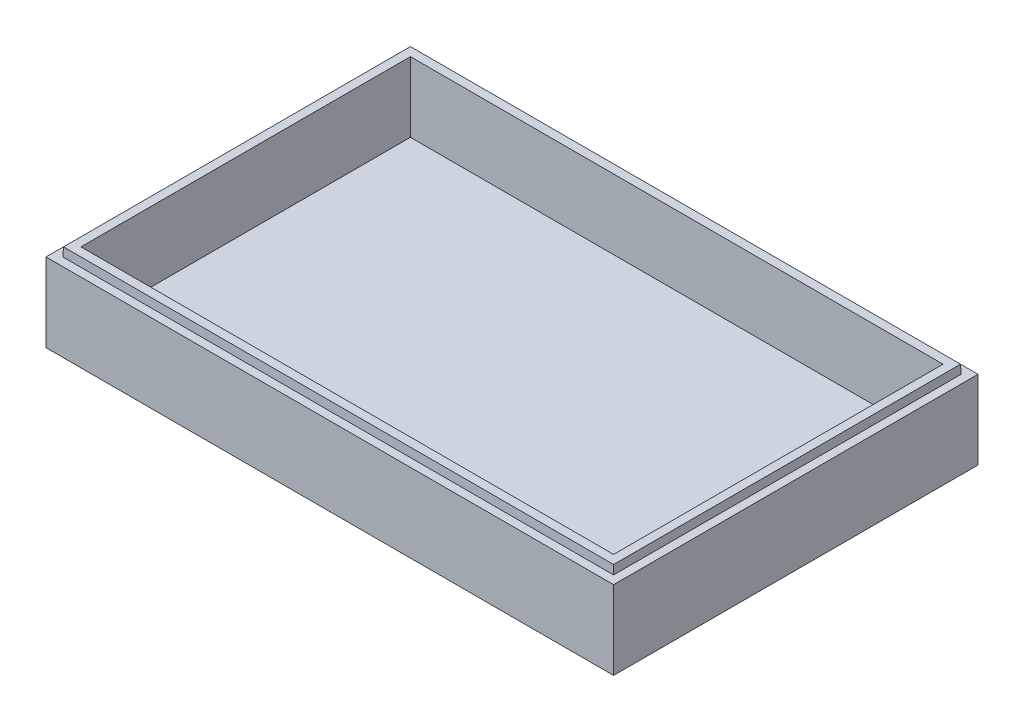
ISO-10303-21;
HEADER;
FILE_DESCRIPTION(('STEP AP214'),'2;1');
FILE_NAME('part.step','',(''),(''),'','','');
FILE_SCHEMA(('AUTOMOTIVE_DESIGN { 1 0 10303 214 1 1 1 1 }'));
ENDSEC;
DATA;
#1=APPLICATION_CONTEXT('core data for automotive mechanical design processes');
#2=APPLICATION_PROTOCOL_DEFINITION('international standard','automotive_design',2000,#1);
#3=PRODUCT_CONTEXT('',#1,'mechanical');
#4=PRODUCT('Part','Part','',(#3));
#5=PRODUCT_RELATED_PRODUCT_CATEGORY('part','',(#4));
#6=PRODUCT_DEFINITION_FORMATION('','',#4);
#7=PRODUCT_DEFINITION_CONTEXT('part definition',#1,'design');
#8=PRODUCT_DEFINITION('design','',#6,#7);
#9=PRODUCT_DEFINITION_SHAPE('','',#8);
#10=(LENGTH_UNIT() NAMED_UNIT(*) SI_UNIT(.MILLI.,.METRE.));
#11=(NAMED_UNIT(*) PLANE_ANGLE_UNIT() SI_UNIT($,.RADIAN.));
#12=(NAMED_UNIT(*) SI_UNIT($,.STERADIAN.) SOLID_ANGLE_UNIT());
#13=UNCERTAINTY_MEASURE_WITH_UNIT(LENGTH_MEASURE(1.E-05),#10,'distance_accuracy_value','');
#14=(GEOMETRIC_REPRESENTATION_CONTEXT(3) GLOBAL_UNCERTAINTY_ASSIGNED_CONTEXT((#13)) GLOBAL_UNIT_ASSIGNED_CONTEXT((#10,
#11,#12)) REPRESENTATION_CONTEXT('',''));
#15=CARTESIAN_POINT('',(0.,0.,0.));
#16=DIRECTION('',(0.,0.,1.));
#17=DIRECTION('',(1.,0.,0.));
#18=AXIS2_PLACEMENT_3D('',#15,#16,#17);
#19=CARTESIAN_POINT('',(0.,20.,83.4381346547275));
#20=DIRECTION('',(0.,1.,0.));
#21=DIRECTION('',(0.,0.,1.));
#22=AXIS2_PLACEMENT_3D('',#19,#20,#21);
#23=PLANE('',#22);
#24=DIRECTION('',(0.,0.,1.));
#25=VECTOR('',#24,1.);
#26=CARTESIAN_POINT('',(4.,20.,0.));
#27=LINE('',#26,#25);
#28=CARTESIAN_POINT('',(4.,20.,4.));
#29=VERTEX_POINT('',#28);
#30=CARTESIAN_POINT('',(4.,20.,79.4381346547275));
#31=VERTEX_POINT('',#30);
#32=EDGE_CURVE('E331',#29,#31,#27,.T.);
#33=ORIENTED_EDGE('',*,*,#32,.F.);
#34=DIRECTION('',(-1.,0.,0.));
#35=VECTOR('',#34,1.);
#36=CARTESIAN_POINT('',(0.,20.,4.));
#37=LINE('',#36,#35);
#38=CARTESIAN_POINT('',(125.966417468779,20.,4.));
#39=VERTEX_POINT('',#38);
#40=EDGE_CURVE('E321',#39,#29,#37,.T.);
#41=ORIENTED_EDGE('',*,*,#40,.F.);
#42=DIRECTION('',(0.,0.,-1.));
#43=VECTOR('',#42,1.);
#44=CARTESIAN_POINT('',(125.966417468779,20.,0.));
#45=LINE('',#44,#43);
#46=CARTESIAN_POINT('',(125.966417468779,20.,79.4381346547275));
#47=VERTEX_POINT('',#46);
#48=EDGE_CURVE('E335',#47,#39,#45,.T.);
#49=ORIENTED_EDGE('',*,*,#48,.F.);
#50=DIRECTION('',(1.,0.,0.));
#51=VECTOR('',#50,1.);
#52=CARTESIAN_POINT('',(0.,20.,79.4381346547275));
#53=LINE('',#52,#51);
#54=EDGE_CURVE('E333',#31,#47,#53,.T.);
#55=ORIENTED_EDGE('',*,*,#54,.F.);
#56=EDGE_LOOP('',(#33,#41,#49,#55));
#57=FACE_BOUND('',#56,.T.);
#58=DIRECTION('',(0.,0.,-1.));
#59=VECTOR('',#58,1.);
#60=CARTESIAN_POINT('',(127.966417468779,20.,83.4381346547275));
#61=LINE('',#60,#59);
#62=CARTESIAN_POINT('',(127.966417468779,20.,81.4381346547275));
#63=VERTEX_POINT('',#62);
#64=CARTESIAN_POINT('',(127.966417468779,20.,2.));
#65=VERTEX_POINT('',#64);
#66=EDGE_CURVE('E269',#63,#65,#61,.T.);
#67=ORIENTED_EDGE('',*,*,#66,.T.);
#68=DIRECTION('',(-1.,0.,0.));
#69=VECTOR('',#68,1.);
#70=CARTESIAN_POINT('',(0.,20.,2.));
#71=LINE('',#70,#69);
#72=CARTESIAN_POINT('',(2.,20.,2.));
#73=VERTEX_POINT('',#72);
#74=EDGE_CURVE('E278',#65,#73,#71,.T.);
#75=ORIENTED_EDGE('',*,*,#74,.T.);
#76=DIRECTION('',(0.,0.,1.));
#77=VECTOR('',#76,1.);
#78=CARTESIAN_POINT('',(2.,20.,83.4381346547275));
#79=LINE('',#78,#77);
#80=CARTESIAN_POINT('',(2.,20.,81.4381346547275));
#81=VERTEX_POINT('',#80);
#82=EDGE_CURVE('E285',#73,#81,#79,.T.);
#83=ORIENTED_EDGE('',*,*,#82,.T.);
#84=DIRECTION('',(1.,0.,0.));
#85=VECTOR('',#84,1.);
#86=CARTESIAN_POINT('',(0.,20.,81.4381346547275));
#87=LINE('',#86,#85);
#88=EDGE_CURVE('E199',#81,#63,#87,.T.);
#89=ORIENTED_EDGE('',*,*,#88,.T.);
#90=EDGE_LOOP('',(#67,#75,#83,#89));
#91=FACE_BOUND('',#90,.T.);
#92=ADVANCED_FACE('F177',(#57,#91),#23,.T.);
#93=CARTESIAN_POINT('',(4.,20.,0.));
#94=DIRECTION('',(1.,0.,0.));
#95=DIRECTION('',(0.,0.,-1.));
#96=AXIS2_PLACEMENT_3D('',#93,#94,#95);
#97=PLANE('',#96);
#98=DIRECTION('',(0.,0.,1.));
#99=VECTOR('',#98,1.);
#100=CARTESIAN_POINT('',(4.,4.,0.));
#101=LINE('',#100,#99);
#102=CARTESIAN_POINT('',(4.,4.,4.));
#103=VERTEX_POINT('',#102);
#104=CARTESIAN_POINT('',(4.,4.,79.4381346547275));
#105=VERTEX_POINT('',#104);
#106=EDGE_CURVE('E308',#103,#105,#101,.T.);
#107=ORIENTED_EDGE('',*,*,#106,.F.);
#108=DIRECTION('',(0.,-1.,0.));
#109=VECTOR('',#108,1.);
#110=CARTESIAN_POINT('',(4.,20.,4.));
#111=LINE('',#110,#109);
#112=EDGE_CURVE('E317',#29,#103,#111,.T.);
#113=ORIENTED_EDGE('',*,*,#112,.F.);
#114=ORIENTED_EDGE('',*,*,#32,.T.);
#115=DIRECTION('',(0.,-1.,0.));
#116=VECTOR('',#115,1.);
#117=CARTESIAN_POINT('',(4.,20.,79.4381346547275));
#118=LINE('',#117,#116);
#119=EDGE_CURVE('E312',#31,#105,#118,.T.);
#120=ORIENTED_EDGE('',*,*,#119,.T.);
#121=EDGE_LOOP('',(#107,#113,#114,#120));
#122=FACE_BOUND('',#121,.T.);
#123=ADVANCED_FACE('F393',(#122),#97,.T.);
#124=CARTESIAN_POINT('',(0.,20.,79.4381346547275));
#125=DIRECTION('',(0.,0.,-1.));
#126=DIRECTION('',(-1.,0.,0.));
#127=AXIS2_PLACEMENT_3D('',#124,#125,#126);
#128=PLANE('',#127);
#129=DIRECTION('',(1.,0.,0.));
#130=VECTOR('',#129,1.);
#131=CARTESIAN_POINT('',(0.,4.,79.4381346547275));
#132=LINE('',#131,#130);
#133=CARTESIAN_POINT('',(125.966417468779,4.,79.4381346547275));
#134=VERTEX_POINT('',#133);
#135=EDGE_CURVE('E311',#105,#134,#132,.T.);
#136=ORIENTED_EDGE('',*,*,#135,.F.);
#137=ORIENTED_EDGE('',*,*,#119,.F.);
#138=ORIENTED_EDGE('',*,*,#54,.T.);
#139=DIRECTION('',(0.,-1.,0.));
#140=VECTOR('',#139,1.);
#141=CARTESIAN_POINT('',(125.966417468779,20.,79.4381346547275));
#142=LINE('',#141,#140);
#143=EDGE_CURVE('E316',#47,#134,#142,.T.);
#144=ORIENTED_EDGE('',*,*,#143,.T.);
#145=EDGE_LOOP('',(#136,#137,#138,#144));
#146=FACE_BOUND('',#145,.T.);
#147=ADVANCED_FACE('F399',(#146),#128,.T.);
#148=CARTESIAN_POINT('',(125.966417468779,20.,0.));
#149=DIRECTION('',(-1.,0.,0.));
#150=DIRECTION('',(0.,0.,1.));
#151=AXIS2_PLACEMENT_3D('',#148,#149,#150);
#152=PLANE('',#151);
#153=DIRECTION('',(0.,0.,-1.));
#154=VECTOR('',#153,1.);
#155=CARTESIAN_POINT('',(125.966417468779,4.,0.));
#156=LINE('',#155,#154);
#157=CARTESIAN_POINT('',(125.966417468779,4.,4.));
#158=VERTEX_POINT('',#157);
#159=EDGE_CURVE('E323',#134,#158,#156,.T.);
#160=ORIENTED_EDGE('',*,*,#159,.F.);
#161=ORIENTED_EDGE('',*,*,#143,.F.);
#162=ORIENTED_EDGE('',*,*,#48,.T.);
#163=DIRECTION('',(0.,-1.,0.));
#164=VECTOR('',#163,1.);
#165=CARTESIAN_POINT('',(125.966417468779,20.,4.));
#166=LINE('',#165,#164);
#167=EDGE_CURVE('E320',#39,#158,#166,.T.);
#168=ORIENTED_EDGE('',*,*,#167,.T.);
#169=EDGE_LOOP('',(#160,#161,#162,#168));
#170=FACE_BOUND('',#169,.T.);
#171=ADVANCED_FACE('F428',(#170),#152,.T.);
#172=CARTESIAN_POINT('',(0.,20.,4.));
#173=DIRECTION('',(0.,0.,1.));
#174=DIRECTION('',(1.,0.,0.));
#175=AXIS2_PLACEMENT_3D('',#172,#173,#174);
#176=PLANE('',#175);
#177=DIRECTION('',(-1.,0.,0.));
#178=VECTOR('',#177,1.);
#179=CARTESIAN_POINT('',(0.,4.,4.));
#180=LINE('',#179,#178);
#181=EDGE_CURVE('E327',#158,#103,#180,.T.);
#182=ORIENTED_EDGE('',*,*,#181,.F.);
#183=ORIENTED_EDGE('',*,*,#167,.F.);
#184=ORIENTED_EDGE('',*,*,#40,.T.);
#185=ORIENTED_EDGE('',*,*,#112,.T.);
#186=EDGE_LOOP('',(#182,#183,#184,#185));
#187=FACE_BOUND('',#186,.T.);
#188=ADVANCED_FACE('F431',(#187),#176,.T.);
#189=CARTESIAN_POINT('',(0.,4.,83.4381346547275));
#190=DIRECTION('',(0.,1.,0.));
#191=DIRECTION('',(0.,0.,1.));
#192=AXIS2_PLACEMENT_3D('',#189,#190,#191);
#193=PLANE('',#192);
#194=ORIENTED_EDGE('',*,*,#106,.T.);
#195=ORIENTED_EDGE('',*,*,#135,.T.);
#196=ORIENTED_EDGE('',*,*,#159,.T.);
#197=ORIENTED_EDGE('',*,*,#181,.T.);
#198=EDGE_LOOP('',(#194,#195,#196,#197));
#199=FACE_BOUND('',#198,.T.);
#200=ADVANCED_FACE('F405',(#199),#193,.T.);
#201=CARTESIAN_POINT('',(0.,18.,83.4381346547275));
#202=DIRECTION('',(0.,1.,0.));
#203=DIRECTION('',(0.,0.,1.));
#204=AXIS2_PLACEMENT_3D('',#201,#202,#203);
#205=PLANE('',#204);
#206=DIRECTION('',(1.,0.,0.));
#207=VECTOR('',#206,1.);
#208=CARTESIAN_POINT('',(0.,18.,1.9301584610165));
#209=LINE('',#208,#207);
#210=CARTESIAN_POINT('',(128.036259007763,18.,1.93015846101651));
#211=VERTEX_POINT('',#210);
#212=CARTESIAN_POINT('',(1.9301584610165,18.,1.93015846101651));
#213=VERTEX_POINT('',#212);
#214=EDGE_CURVE('E300',#211,#213,#209,.F.);
#215=ORIENTED_EDGE('',*,*,#214,.F.);
#216=DIRECTION('',(0.,0.,1.));
#217=VECTOR('',#216,1.);
#218=CARTESIAN_POINT('',(128.036259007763,18.,83.4381346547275));
#219=LINE('',#218,#217);
#220=CARTESIAN_POINT('',(128.036259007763,18.,81.507976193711));
#221=VERTEX_POINT('',#220);
#222=EDGE_CURVE('E271',#221,#211,#219,.F.);
#223=ORIENTED_EDGE('',*,*,#222,.F.);
#224=DIRECTION('',(-1.,0.,0.));
#225=VECTOR('',#224,1.);
#226=CARTESIAN_POINT('',(0.,18.,81.507976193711));
#227=LINE('',#226,#225);
#228=CARTESIAN_POINT('',(1.9301584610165,18.,81.507976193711));
#229=VERTEX_POINT('',#228);
#230=EDGE_CURVE('E287',#229,#221,#227,.F.);
#231=ORIENTED_EDGE('',*,*,#230,.F.);
#232=DIRECTION('',(0.,0.,-1.));
#233=VECTOR('',#232,1.);
#234=CARTESIAN_POINT('',(1.9301584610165,18.,83.4381346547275));
#235=LINE('',#234,#233);
#236=EDGE_CURVE('E293',#213,#229,#235,.F.);
#237=ORIENTED_EDGE('',*,*,#236,.F.);
#238=EDGE_LOOP('',(#215,#223,#231,#237));
#239=FACE_BOUND('',#238,.T.);
#240=DIRECTION('',(0.,0.,1.));
#241=VECTOR('',#240,1.);
#242=CARTESIAN_POINT('',(0.,18.,0.));
#243=LINE('',#242,#241);
#244=CARTESIAN_POINT('',(0.,18.,0.));
#245=VERTEX_POINT('',#244);
#246=CARTESIAN_POINT('',(0.,18.,83.4381346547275));
#247=VERTEX_POINT('',#246);
#248=EDGE_CURVE('E306',#245,#247,#243,.T.);
#249=ORIENTED_EDGE('',*,*,#248,.T.);
#250=DIRECTION('',(1.,0.,0.));
#251=VECTOR('',#250,1.);
#252=CARTESIAN_POINT('',(0.,18.,83.4381346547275));
#253=LINE('',#252,#251);
#254=CARTESIAN_POINT('',(129.966417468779,18.,83.4381346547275));
#255=VERTEX_POINT('',#254);
#256=EDGE_CURVE('E304',#247,#255,#253,.T.);
#257=ORIENTED_EDGE('',*,*,#256,.T.);
#258=DIRECTION('',(0.,0.,-1.));
#259=VECTOR('',#258,1.);
#260=CARTESIAN_POINT('',(129.966417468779,18.,0.));
#261=LINE('',#260,#259);
#262=CARTESIAN_POINT('',(129.966417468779,18.,0.));
#263=VERTEX_POINT('',#262);
#264=EDGE_CURVE('E191',#255,#263,#261,.T.);
#265=ORIENTED_EDGE('',*,*,#264,.T.);
#266=DIRECTION('',(-1.,0.,0.));
#267=VECTOR('',#266,1.);
#268=CARTESIAN_POINT('',(0.,18.,0.));
#269=LINE('',#268,#267);
#270=EDGE_CURVE('E13',#263,#245,#269,.T.);
#271=ORIENTED_EDGE('',*,*,#270,.T.);
#272=EDGE_LOOP('',(#249,#257,#265,#271));
#273=FACE_BOUND('',#272,.T.);
#274=ADVANCED_FACE('F421',(#239,#273),#205,.T.);
#275=CARTESIAN_POINT('',(0.,20.,2.));
#276=DIRECTION('',(0.,-0.0348994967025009,0.999390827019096));
#277=DIRECTION('',(0.,-0.999390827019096,-0.0348994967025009));
#278=AXIS2_PLACEMENT_3D('',#275,#276,#277);
#279=PLANE('',#278);
#280=ORIENTED_EDGE('',*,*,#74,.F.);
#281=DIRECTION('',(-0.0348782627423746,0.998782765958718,0.0348782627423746));
#282=VECTOR('',#281,1.);
#283=CARTESIAN_POINT('',(127.86734853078,22.8369632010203,2.09906893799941));
#284=LINE('',#283,#282);
#285=EDGE_CURVE('E265',#211,#65,#284,.T.);
#286=ORIENTED_EDGE('',*,*,#285,.F.);
#287=ORIENTED_EDGE('',*,*,#214,.T.);
#288=DIRECTION('',(0.0348782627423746,0.998782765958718,0.0348782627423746));
#289=VECTOR('',#288,1.);
#290=CARTESIAN_POINT('',(1.99756701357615,19.9303283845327,1.99756701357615));
#291=LINE('',#290,#289);
#292=EDGE_CURVE('E280',#213,#73,#291,.T.);
#293=ORIENTED_EDGE('',*,*,#292,.T.);
#294=EDGE_LOOP('',(#280,#286,#287,#293));
#295=FACE_BOUND('',#294,.T.);
#296=ADVANCED_FACE('F279',(#295),#279,.F.);
#297=CARTESIAN_POINT('',(127.966417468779,20.,83.4381346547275));
#298=DIRECTION('',(-0.999390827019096,-0.0348994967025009,0.));
#299=DIRECTION('',(0.0348994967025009,-0.999390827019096,0.));
#300=AXIS2_PLACEMENT_3D('',#297,#298,#299);
#301=PLANE('',#300);
#302=ORIENTED_EDGE('',*,*,#66,.F.);
#303=DIRECTION('',(-0.0348782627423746,0.998782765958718,-0.0348782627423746));
#304=VECTOR('',#303,1.);
#305=CARTESIAN_POINT('',(127.810747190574,24.4578135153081,81.2824643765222));
#306=LINE('',#305,#304);
#307=EDGE_CURVE('E275',#221,#63,#306,.T.);
#308=ORIENTED_EDGE('',*,*,#307,.F.);
#309=ORIENTED_EDGE('',*,*,#222,.T.);
#310=ORIENTED_EDGE('',*,*,#285,.T.);
#311=EDGE_LOOP('',(#302,#308,#309,#310));
#312=FACE_BOUND('',#311,.T.);
#313=ADVANCED_FACE('F267',(#312),#301,.F.);
#314=CARTESIAN_POINT('',(0.,20.,81.4381346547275));
#315=DIRECTION('',(0.,-0.0348994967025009,-0.999390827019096));
#316=DIRECTION('',(0.,0.999390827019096,-0.0348994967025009));
#317=AXIS2_PLACEMENT_3D('',#314,#315,#316);
#318=PLANE('',#317);
#319=ORIENTED_EDGE('',*,*,#88,.F.);
#320=DIRECTION('',(0.0348782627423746,0.998782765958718,-0.0348782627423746));
#321=VECTOR('',#320,1.);
#322=CARTESIAN_POINT('',(1.99756701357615,19.9303283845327,81.4405676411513));
#323=LINE('',#322,#321);
#324=EDGE_CURVE('E291',#229,#81,#323,.T.);
#325=ORIENTED_EDGE('',*,*,#324,.F.);
#326=ORIENTED_EDGE('',*,*,#230,.T.);
#327=ORIENTED_EDGE('',*,*,#307,.T.);
#328=EDGE_LOOP('',(#319,#325,#326,#327));
#329=FACE_BOUND('',#328,.T.);
#330=ADVANCED_FACE('F412',(#329),#318,.F.);
#331=CARTESIAN_POINT('',(2.,20.,83.4381346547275));
#332=DIRECTION('',(0.999390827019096,-0.0348994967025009,0.));
#333=DIRECTION('',(0.0348994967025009,0.999390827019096,0.));
#334=AXIS2_PLACEMENT_3D('',#331,#332,#333);
#335=PLANE('',#334);
#336=ORIENTED_EDGE('',*,*,#82,.F.);
#337=ORIENTED_EDGE('',*,*,#292,.F.);
#338=ORIENTED_EDGE('',*,*,#236,.T.);
#339=ORIENTED_EDGE('',*,*,#324,.T.);
#340=EDGE_LOOP('',(#336,#337,#338,#339));
#341=FACE_BOUND('',#340,.T.);
#342=ADVANCED_FACE('F408',(#341),#335,.F.);
#343=CARTESIAN_POINT('',(0.,0.,83.4381346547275));
#344=DIRECTION('',(0.,1.,0.));
#345=DIRECTION('',(0.,0.,1.));
#346=AXIS2_PLACEMENT_3D('',#343,#344,#345);
#347=PLANE('',#346);
#348=DIRECTION('',(0.,0.,1.));
#349=VECTOR('',#348,1.);
#350=CARTESIAN_POINT('',(0.,0.,0.));
#351=LINE('',#350,#349);
#352=CARTESIAN_POINT('',(0.,0.,0.));
#353=VERTEX_POINT('',#352);
#354=CARTESIAN_POINT('',(0.,0.,83.4381346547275));
#355=VERTEX_POINT('',#354);
#356=EDGE_CURVE('E315',#353,#355,#351,.T.);
#357=ORIENTED_EDGE('',*,*,#356,.F.);
#358=DIRECTION('',(-1.,0.,0.));
#359=VECTOR('',#358,1.);
#360=CARTESIAN_POINT('',(0.,0.,0.));
#361=LINE('',#360,#359);
#362=CARTESIAN_POINT('',(129.966417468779,0.,0.));
#363=VERTEX_POINT('',#362);
#364=EDGE_CURVE('E347',#363,#353,#361,.T.);
#365=ORIENTED_EDGE('',*,*,#364,.F.);
#366=DIRECTION('',(0.,0.,-1.));
#367=VECTOR('',#366,1.);
#368=CARTESIAN_POINT('',(129.966417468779,0.,0.));
#369=LINE('',#368,#367);
#370=CARTESIAN_POINT('',(129.966417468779,0.,83.4381346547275));
#371=VERTEX_POINT('',#370);
#372=EDGE_CURVE('E344',#371,#363,#369,.T.);
#373=ORIENTED_EDGE('',*,*,#372,.F.);
#374=DIRECTION('',(1.,0.,0.));
#375=VECTOR('',#374,1.);
#376=CARTESIAN_POINT('',(0.,0.,83.4381346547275));
#377=LINE('',#376,#375);
#378=EDGE_CURVE('E341',#355,#371,#377,.T.);
#379=ORIENTED_EDGE('',*,*,#378,.F.);
#380=EDGE_LOOP('',(#357,#365,#373,#379));
#381=FACE_BOUND('',#380,.T.);
#382=ADVANCED_FACE('F377',(#381),#347,.F.);
#383=CARTESIAN_POINT('',(0.,20.,0.));
#384=DIRECTION('',(0.,0.,1.));
#385=DIRECTION('',(1.,0.,0.));
#386=AXIS2_PLACEMENT_3D('',#383,#384,#385);
#387=PLANE('',#386);
#388=ORIENTED_EDGE('',*,*,#270,.F.);
#389=DIRECTION('',(0.,-1.,0.));
#390=VECTOR('',#389,1.);
#391=CARTESIAN_POINT('',(129.966417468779,20.,0.));
#392=LINE('',#391,#390);
#393=EDGE_CURVE('E352',#263,#363,#392,.T.);
#394=ORIENTED_EDGE('',*,*,#393,.T.);
#395=ORIENTED_EDGE('',*,*,#364,.T.);
#396=DIRECTION('',(0.,-1.,0.));
#397=VECTOR('',#396,1.);
#398=CARTESIAN_POINT('',(0.,20.,0.));
#399=LINE('',#398,#397);
#400=EDGE_CURVE('E350',#245,#353,#399,.T.);
#401=ORIENTED_EDGE('',*,*,#400,.F.);
#402=EDGE_LOOP('',(#388,#394,#395,#401));
#403=FACE_BOUND('',#402,.T.);
#404=ADVANCED_FACE('F381',(#403),#387,.F.);
#405=CARTESIAN_POINT('',(129.966417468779,20.,0.));
#406=DIRECTION('',(-1.,0.,0.));
#407=DIRECTION('',(0.,0.,1.));
#408=AXIS2_PLACEMENT_3D('',#405,#406,#407);
#409=PLANE('',#408);
#410=ORIENTED_EDGE('',*,*,#264,.F.);
#411=DIRECTION('',(0.,-1.,0.));
#412=VECTOR('',#411,1.);
#413=CARTESIAN_POINT('',(129.966417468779,20.,83.4381346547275));
#414=LINE('',#413,#412);
#415=EDGE_CURVE('E354',#255,#371,#414,.T.);
#416=ORIENTED_EDGE('',*,*,#415,.T.);
#417=ORIENTED_EDGE('',*,*,#372,.T.);
#418=ORIENTED_EDGE('',*,*,#393,.F.);
#419=EDGE_LOOP('',(#410,#416,#417,#418));
#420=FACE_BOUND('',#419,.T.);
#421=ADVANCED_FACE('F384',(#420),#409,.F.);
#422=CARTESIAN_POINT('',(0.,20.,83.4381346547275));
#423=DIRECTION('',(0.,0.,-1.));
#424=DIRECTION('',(-1.,0.,0.));
#425=AXIS2_PLACEMENT_3D('',#422,#423,#424);
#426=PLANE('',#425);
#427=ORIENTED_EDGE('',*,*,#256,.F.);
#428=DIRECTION('',(0.,-1.,0.));
#429=VECTOR('',#428,1.);
#430=CARTESIAN_POINT('',(0.,20.,83.4381346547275));
#431=LINE('',#430,#429);
#432=EDGE_CURVE('E185',#247,#355,#431,.T.);
#433=ORIENTED_EDGE('',*,*,#432,.T.);
#434=ORIENTED_EDGE('',*,*,#378,.T.);
#435=ORIENTED_EDGE('',*,*,#415,.F.);
#436=EDGE_LOOP('',(#427,#433,#434,#435));
#437=FACE_BOUND('',#436,.T.);
#438=ADVANCED_FACE('F370',(#437),#426,.F.);
#439=CARTESIAN_POINT('',(0.,20.,0.));
#440=DIRECTION('',(1.,0.,0.));
#441=DIRECTION('',(0.,0.,-1.));
#442=AXIS2_PLACEMENT_3D('',#439,#440,#441);
#443=PLANE('',#442);
#444=ORIENTED_EDGE('',*,*,#248,.F.);
#445=ORIENTED_EDGE('',*,*,#400,.T.);
#446=ORIENTED_EDGE('',*,*,#356,.T.);
#447=ORIENTED_EDGE('',*,*,#432,.F.);
#448=EDGE_LOOP('',(#444,#445,#446,#447));
#449=FACE_BOUND('',#448,.T.);
#450=ADVANCED_FACE('F179',(#449),#443,.F.);
#451=CLOSED_SHELL('',(#92,#123,#147,#171,#188,#200,#274,#296,#313,#330,#342,#382,#404,#421,#438,#450));
#452=MANIFOLD_SOLID_BREP('B2',#451);
#453=ADVANCED_BREP_SHAPE_REPRESENTATION('',(#18,#452),#14);
#454=SHAPE_DEFINITION_REPRESENTATION(#9,#453);
ENDSEC;
END-ISO-10303-21;
